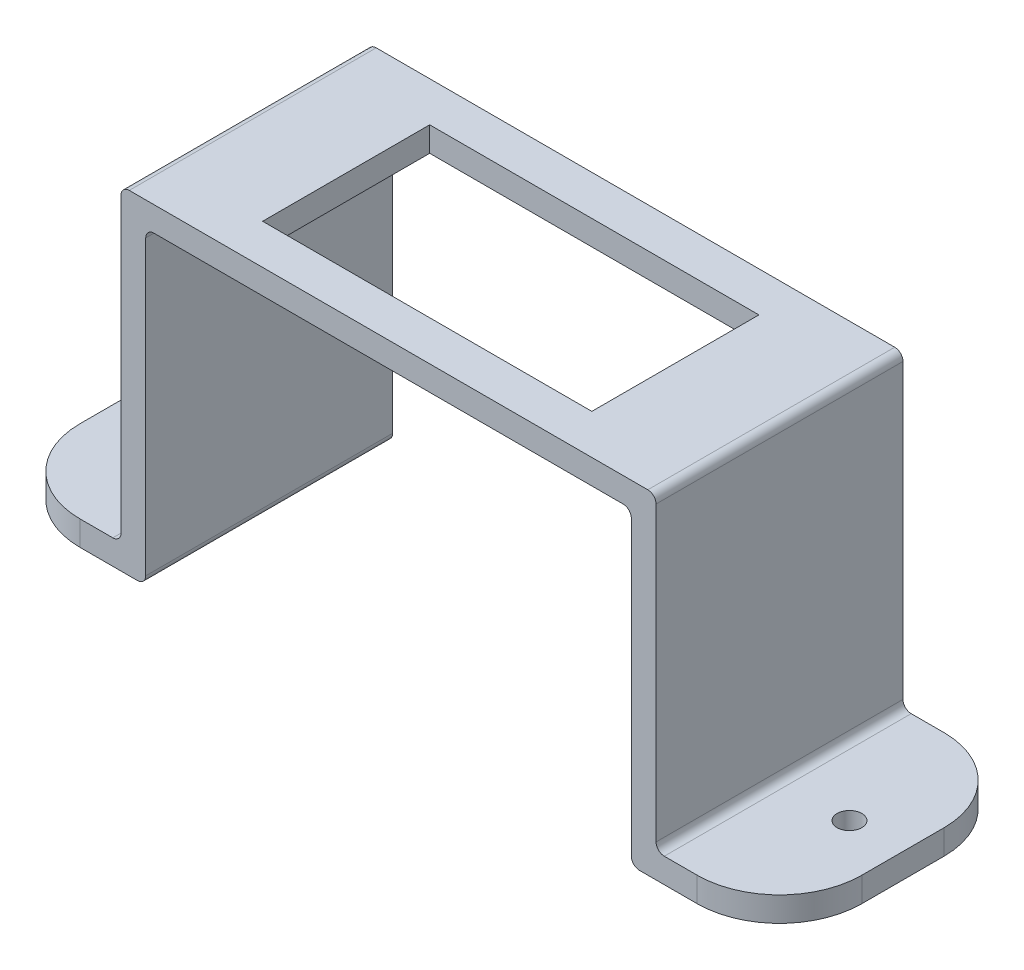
ISO-10303-21;
HEADER;
FILE_DESCRIPTION(('STEP AP214'),'2;1');
FILE_NAME('part.step','',(''),(''),'','','');
FILE_SCHEMA(('AUTOMOTIVE_DESIGN { 1 0 10303 214 1 1 1 1 }'));
ENDSEC;
DATA;
#1=APPLICATION_CONTEXT('core data for automotive mechanical design processes');
#2=APPLICATION_PROTOCOL_DEFINITION('international standard','automotive_design',2000,#1);
#3=PRODUCT_CONTEXT('',#1,'mechanical');
#4=PRODUCT('Part','Part','',(#3));
#5=PRODUCT_RELATED_PRODUCT_CATEGORY('part','',(#4));
#6=PRODUCT_DEFINITION_FORMATION('','',#4);
#7=PRODUCT_DEFINITION_CONTEXT('part definition',#1,'design');
#8=PRODUCT_DEFINITION('design','',#6,#7);
#9=PRODUCT_DEFINITION_SHAPE('','',#8);
#10=(LENGTH_UNIT() NAMED_UNIT(*) SI_UNIT(.MILLI.,.METRE.));
#11=(NAMED_UNIT(*) PLANE_ANGLE_UNIT() SI_UNIT($,.RADIAN.));
#12=(NAMED_UNIT(*) SI_UNIT($,.STERADIAN.) SOLID_ANGLE_UNIT());
#13=UNCERTAINTY_MEASURE_WITH_UNIT(LENGTH_MEASURE(1.E-05),#10,'distance_accuracy_value','');
#14=(GEOMETRIC_REPRESENTATION_CONTEXT(3) GLOBAL_UNCERTAINTY_ASSIGNED_CONTEXT((#13)) GLOBAL_UNIT_ASSIGNED_CONTEXT((#10,
#11,#12)) REPRESENTATION_CONTEXT('',''));
#15=CARTESIAN_POINT('',(0.,0.,0.));
#16=DIRECTION('',(0.,0.,1.));
#17=DIRECTION('',(1.,0.,0.));
#18=AXIS2_PLACEMENT_3D('',#15,#16,#17);
#19=CARTESIAN_POINT('',(80.,-3.,30.));
#20=DIRECTION('',(0.,1.,0.));
#21=DIRECTION('',(0.,0.,1.));
#22=AXIS2_PLACEMENT_3D('',#19,#20,#21);
#23=PLANE('',#22);
#24=CARTESIAN_POINT('',(88.5,-3.,15.));
#25=DIRECTION('',(0.,1.,0.));
#26=DIRECTION('',(0.,0.,1.));
#27=AXIS2_PLACEMENT_3D('',#24,#25,#26);
#28=CIRCLE('',#27,1.5);
#29=CARTESIAN_POINT('',(88.5,-3.,16.5));
#30=VERTEX_POINT('',#29);
#31=EDGE_CURVE('E260',#30,#30,#28,.T.);
#32=ORIENTED_EDGE('',*,*,#31,.T.);
#33=EDGE_LOOP('',(#32));
#34=FACE_BOUND('',#33,.T.);
#35=DIRECTION('',(1.,0.,0.));
#36=VECTOR('',#35,1.);
#37=CARTESIAN_POINT('',(80.,-3.,0.));
#38=LINE('',#37,#36);
#39=CARTESIAN_POINT('',(78.,-3.,0.));
#40=VERTEX_POINT('',#39);
#41=CARTESIAN_POINT('',(85.,-3.,0.));
#42=VERTEX_POINT('',#41);
#43=EDGE_CURVE('E263',#40,#42,#38,.T.);
#44=ORIENTED_EDGE('',*,*,#43,.T.);
#45=CARTESIAN_POINT('',(85.,-3.,10.));
#46=DIRECTION('',(0.,1.,0.));
#47=DIRECTION('',(0.,0.,1.));
#48=AXIS2_PLACEMENT_3D('',#45,#46,#47);
#49=CIRCLE('',#48,10.);
#50=CARTESIAN_POINT('',(95.,-3.,10.));
#51=VERTEX_POINT('',#50);
#52=EDGE_CURVE('E55',#42,#51,#49,.F.);
#53=ORIENTED_EDGE('',*,*,#52,.T.);
#54=DIRECTION('',(0.,0.,-1.));
#55=VECTOR('',#54,1.);
#56=CARTESIAN_POINT('',(95.,-3.,30.));
#57=LINE('',#56,#55);
#58=CARTESIAN_POINT('',(95.,-3.,20.));
#59=VERTEX_POINT('',#58);
#60=EDGE_CURVE('E324',#59,#51,#57,.T.);
#61=ORIENTED_EDGE('',*,*,#60,.F.);
#62=CARTESIAN_POINT('',(85.,-3.,20.));
#63=DIRECTION('',(0.,1.,0.));
#64=DIRECTION('',(0.,0.,1.));
#65=AXIS2_PLACEMENT_3D('',#62,#63,#64);
#66=CIRCLE('',#65,10.);
#67=CARTESIAN_POINT('',(85.,-3.,30.));
#68=VERTEX_POINT('',#67);
#69=EDGE_CURVE('E427',#59,#68,#66,.F.);
#70=ORIENTED_EDGE('',*,*,#69,.T.);
#71=DIRECTION('',(1.,0.,0.));
#72=VECTOR('',#71,1.);
#73=CARTESIAN_POINT('',(80.,-3.,30.));
#74=LINE('',#73,#72);
#75=CARTESIAN_POINT('',(78.,-3.,30.));
#76=VERTEX_POINT('',#75);
#77=EDGE_CURVE('E266',#76,#68,#74,.T.);
#78=ORIENTED_EDGE('',*,*,#77,.F.);
#79=DIRECTION('',(0.,0.,-1.));
#80=VECTOR('',#79,1.);
#81=CARTESIAN_POINT('',(78.,-3.,30.));
#82=LINE('',#81,#80);
#83=EDGE_CURVE('E354',#76,#40,#82,.T.);
#84=ORIENTED_EDGE('',*,*,#83,.T.);
#85=EDGE_LOOP('',(#44,#53,#61,#70,#78,#84));
#86=FACE_BOUND('',#85,.T.);
#87=ADVANCED_FACE('F33',(#34,#86),#23,.F.);
#88=CARTESIAN_POINT('',(95.,0.,30.));
#89=DIRECTION('',(1.,0.,0.));
#90=DIRECTION('',(0.,0.,-1.));
#91=AXIS2_PLACEMENT_3D('',#88,#89,#90);
#92=PLANE('',#91);
#93=ORIENTED_EDGE('',*,*,#60,.T.);
#94=DIRECTION('',(0.,-1.,0.));
#95=VECTOR('',#94,1.);
#96=CARTESIAN_POINT('',(95.,0.,10.));
#97=LINE('',#96,#95);
#98=CARTESIAN_POINT('',(95.,0.,10.));
#99=VERTEX_POINT('',#98);
#100=EDGE_CURVE('E41',#51,#99,#97,.F.);
#101=ORIENTED_EDGE('',*,*,#100,.T.);
#102=DIRECTION('',(0.,0.,-1.));
#103=VECTOR('',#102,1.);
#104=CARTESIAN_POINT('',(95.,0.,30.));
#105=LINE('',#104,#103);
#106=CARTESIAN_POINT('',(95.,0.,20.));
#107=VERTEX_POINT('',#106);
#108=EDGE_CURVE('E322',#107,#99,#105,.T.);
#109=ORIENTED_EDGE('',*,*,#108,.F.);
#110=DIRECTION('',(0.,-1.,0.));
#111=VECTOR('',#110,1.);
#112=CARTESIAN_POINT('',(95.,-3.,20.));
#113=LINE('',#112,#111);
#114=EDGE_CURVE('E424',#107,#59,#113,.T.);
#115=ORIENTED_EDGE('',*,*,#114,.T.);
#116=EDGE_LOOP('',(#93,#101,#109,#115));
#117=FACE_BOUND('',#116,.T.);
#118=ADVANCED_FACE('F551',(#117),#92,.T.);
#119=CARTESIAN_POINT('',(80.,0.,30.));
#120=DIRECTION('',(0.,1.,0.));
#121=DIRECTION('',(0.,0.,1.));
#122=AXIS2_PLACEMENT_3D('',#119,#120,#121);
#123=PLANE('',#122);
#124=CARTESIAN_POINT('',(88.5,0.,15.));
#125=DIRECTION('',(0.,1.,0.));
#126=DIRECTION('',(0.,0.,1.));
#127=AXIS2_PLACEMENT_3D('',#124,#125,#126);
#128=CIRCLE('',#127,1.5);
#129=CARTESIAN_POINT('',(88.5,0.,16.5));
#130=VERTEX_POINT('',#129);
#131=EDGE_CURVE('E257',#130,#130,#128,.T.);
#132=ORIENTED_EDGE('',*,*,#131,.F.);
#133=EDGE_LOOP('',(#132));
#134=FACE_BOUND('',#133,.T.);
#135=ORIENTED_EDGE('',*,*,#108,.T.);
#136=CARTESIAN_POINT('',(85.,0.,10.));
#137=DIRECTION('',(0.,1.,0.));
#138=DIRECTION('',(0.,0.,1.));
#139=AXIS2_PLACEMENT_3D('',#136,#137,#138);
#140=CIRCLE('',#139,10.);
#141=CARTESIAN_POINT('',(85.,0.,0.));
#142=VERTEX_POINT('',#141);
#143=EDGE_CURVE('E11',#99,#142,#140,.T.);
#144=ORIENTED_EDGE('',*,*,#143,.T.);
#145=DIRECTION('',(1.,0.,0.));
#146=VECTOR('',#145,1.);
#147=CARTESIAN_POINT('',(80.,0.,0.));
#148=LINE('',#147,#146);
#149=CARTESIAN_POINT('',(81.,0.,0.));
#150=VERTEX_POINT('',#149);
#151=EDGE_CURVE('E295',#150,#142,#148,.T.);
#152=ORIENTED_EDGE('',*,*,#151,.F.);
#153=DIRECTION('',(0.,0.,-1.));
#154=VECTOR('',#153,1.);
#155=CARTESIAN_POINT('',(81.,0.,30.));
#156=LINE('',#155,#154);
#157=CARTESIAN_POINT('',(81.,0.,30.));
#158=VERTEX_POINT('',#157);
#159=EDGE_CURVE('E397',#150,#158,#156,.F.);
#160=ORIENTED_EDGE('',*,*,#159,.T.);
#161=DIRECTION('',(1.,0.,0.));
#162=VECTOR('',#161,1.);
#163=CARTESIAN_POINT('',(80.,0.,30.));
#164=LINE('',#163,#162);
#165=CARTESIAN_POINT('',(85.,0.,30.));
#166=VERTEX_POINT('',#165);
#167=EDGE_CURVE('E269',#158,#166,#164,.T.);
#168=ORIENTED_EDGE('',*,*,#167,.T.);
#169=CARTESIAN_POINT('',(85.,0.,20.));
#170=DIRECTION('',(0.,1.,0.));
#171=DIRECTION('',(0.,0.,1.));
#172=AXIS2_PLACEMENT_3D('',#169,#170,#171);
#173=CIRCLE('',#172,10.);
#174=EDGE_CURVE('E429',#166,#107,#173,.T.);
#175=ORIENTED_EDGE('',*,*,#174,.T.);
#176=EDGE_LOOP('',(#135,#144,#152,#160,#168,#175));
#177=FACE_BOUND('',#176,.T.);
#178=ADVANCED_FACE('F506',(#134,#177),#123,.T.);
#179=CARTESIAN_POINT('',(80.,37.5557142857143,30.));
#180=DIRECTION('',(1.,0.,0.));
#181=DIRECTION('',(0.,0.,-1.));
#182=AXIS2_PLACEMENT_3D('',#179,#180,#181);
#183=PLANE('',#182);
#184=DIRECTION('',(0.,-1.,0.));
#185=VECTOR('',#184,1.);
#186=CARTESIAN_POINT('',(80.,37.5557142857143,30.));
#187=LINE('',#186,#185);
#188=CARTESIAN_POINT('',(80.,36.5557142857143,30.));
#189=VERTEX_POINT('',#188);
#190=CARTESIAN_POINT('',(80.,1.,30.));
#191=VERTEX_POINT('',#190);
#192=EDGE_CURVE('E273',#189,#191,#187,.T.);
#193=ORIENTED_EDGE('',*,*,#192,.T.);
#194=DIRECTION('',(0.,0.,-1.));
#195=VECTOR('',#194,1.);
#196=CARTESIAN_POINT('',(80.,1.,0.));
#197=LINE('',#196,#195);
#198=CARTESIAN_POINT('',(80.,1.,0.));
#199=VERTEX_POINT('',#198);
#200=EDGE_CURVE('E394',#191,#199,#197,.T.);
#201=ORIENTED_EDGE('',*,*,#200,.T.);
#202=DIRECTION('',(0.,-1.,0.));
#203=VECTOR('',#202,1.);
#204=CARTESIAN_POINT('',(80.,37.5557142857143,0.));
#205=LINE('',#204,#203);
#206=CARTESIAN_POINT('',(80.,36.5557142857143,0.));
#207=VERTEX_POINT('',#206);
#208=EDGE_CURVE('E298',#207,#199,#205,.T.);
#209=ORIENTED_EDGE('',*,*,#208,.F.);
#210=DIRECTION('',(0.,0.,-1.));
#211=VECTOR('',#210,1.);
#212=CARTESIAN_POINT('',(80.,36.5557142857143,30.));
#213=LINE('',#212,#211);
#214=EDGE_CURVE('E352',#207,#189,#213,.F.);
#215=ORIENTED_EDGE('',*,*,#214,.T.);
#216=EDGE_LOOP('',(#193,#201,#209,#215));
#217=FACE_BOUND('',#216,.T.);
#218=ADVANCED_FACE('F496',(#217),#183,.T.);
#219=CARTESIAN_POINT('',(15.,37.5557142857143,30.));
#220=DIRECTION('',(0.,1.,0.));
#221=DIRECTION('',(0.,0.,1.));
#222=AXIS2_PLACEMENT_3D('',#219,#220,#221);
#223=PLANE('',#222);
#224=DIRECTION('',(0.,0.,1.));
#225=VECTOR('',#224,1.);
#226=CARTESIAN_POINT('',(27.35,37.5557142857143,25.15));
#227=LINE('',#226,#225);
#228=CARTESIAN_POINT('',(27.35,37.5557142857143,4.85));
#229=VERTEX_POINT('',#228);
#230=CARTESIAN_POINT('',(27.35,37.5557142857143,25.15));
#231=VERTEX_POINT('',#230);
#232=EDGE_CURVE('E239',#229,#231,#227,.T.);
#233=ORIENTED_EDGE('',*,*,#232,.F.);
#234=DIRECTION('',(-1.,0.,0.));
#235=VECTOR('',#234,1.);
#236=CARTESIAN_POINT('',(27.35,37.5557142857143,4.85));
#237=LINE('',#236,#235);
#238=CARTESIAN_POINT('',(67.35,37.5557142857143,4.85));
#239=VERTEX_POINT('',#238);
#240=EDGE_CURVE('E244',#239,#229,#237,.T.);
#241=ORIENTED_EDGE('',*,*,#240,.F.);
#242=DIRECTION('',(0.,0.,-1.));
#243=VECTOR('',#242,1.);
#244=CARTESIAN_POINT('',(67.35,37.5557142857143,25.15));
#245=LINE('',#244,#243);
#246=CARTESIAN_POINT('',(67.35,37.5557142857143,25.15));
#247=VERTEX_POINT('',#246);
#248=EDGE_CURVE('E223',#247,#239,#245,.T.);
#249=ORIENTED_EDGE('',*,*,#248,.F.);
#250=DIRECTION('',(1.,0.,0.));
#251=VECTOR('',#250,1.);
#252=CARTESIAN_POINT('',(27.35,37.5557142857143,25.15));
#253=LINE('',#252,#251);
#254=EDGE_CURVE('E234',#231,#247,#253,.T.);
#255=ORIENTED_EDGE('',*,*,#254,.F.);
#256=EDGE_LOOP('',(#233,#241,#249,#255));
#257=FACE_BOUND('',#256,.T.);
#258=DIRECTION('',(1.,0.,0.));
#259=VECTOR('',#258,1.);
#260=CARTESIAN_POINT('',(15.,37.5557142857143,0.));
#261=LINE('',#260,#259);
#262=CARTESIAN_POINT('',(16.,37.5557142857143,0.));
#263=VERTEX_POINT('',#262);
#264=CARTESIAN_POINT('',(79.,37.5557142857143,0.));
#265=VERTEX_POINT('',#264);
#266=EDGE_CURVE('E301',#263,#265,#261,.T.);
#267=ORIENTED_EDGE('',*,*,#266,.F.);
#268=DIRECTION('',(0.,0.,-1.));
#269=VECTOR('',#268,1.);
#270=CARTESIAN_POINT('',(16.,37.5557142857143,30.));
#271=LINE('',#270,#269);
#272=CARTESIAN_POINT('',(16.,37.5557142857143,30.));
#273=VERTEX_POINT('',#272);
#274=EDGE_CURVE('E345',#263,#273,#271,.F.);
#275=ORIENTED_EDGE('',*,*,#274,.T.);
#276=DIRECTION('',(1.,0.,0.));
#277=VECTOR('',#276,1.);
#278=CARTESIAN_POINT('',(15.,37.5557142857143,30.));
#279=LINE('',#278,#277);
#280=CARTESIAN_POINT('',(79.,37.5557142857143,30.));
#281=VERTEX_POINT('',#280);
#282=EDGE_CURVE('E276',#273,#281,#279,.T.);
#283=ORIENTED_EDGE('',*,*,#282,.T.);
#284=DIRECTION('',(0.,0.,-1.));
#285=VECTOR('',#284,1.);
#286=CARTESIAN_POINT('',(79.,37.5557142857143,30.));
#287=LINE('',#286,#285);
#288=EDGE_CURVE('E342',#281,#265,#287,.T.);
#289=ORIENTED_EDGE('',*,*,#288,.T.);
#290=EDGE_LOOP('',(#267,#275,#283,#289));
#291=FACE_BOUND('',#290,.T.);
#292=ADVANCED_FACE('F241',(#257,#291),#223,.T.);
#293=CARTESIAN_POINT('',(15.,0.,30.));
#294=DIRECTION('',(-1.,0.,0.));
#295=DIRECTION('',(0.,0.,1.));
#296=AXIS2_PLACEMENT_3D('',#293,#294,#295);
#297=PLANE('',#296);
#298=DIRECTION('',(0.,1.,0.));
#299=VECTOR('',#298,1.);
#300=CARTESIAN_POINT('',(15.,0.,0.));
#301=LINE('',#300,#299);
#302=CARTESIAN_POINT('',(15.,1.,0.));
#303=VERTEX_POINT('',#302);
#304=CARTESIAN_POINT('',(15.,36.5557142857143,0.));
#305=VERTEX_POINT('',#304);
#306=EDGE_CURVE('E304',#303,#305,#301,.T.);
#307=ORIENTED_EDGE('',*,*,#306,.F.);
#308=DIRECTION('',(0.,0.,-1.));
#309=VECTOR('',#308,1.);
#310=CARTESIAN_POINT('',(15.,1.,30.));
#311=LINE('',#310,#309);
#312=CARTESIAN_POINT('',(15.,1.,30.));
#313=VERTEX_POINT('',#312);
#314=EDGE_CURVE('E406',#303,#313,#311,.F.);
#315=ORIENTED_EDGE('',*,*,#314,.T.);
#316=DIRECTION('',(0.,1.,0.));
#317=VECTOR('',#316,1.);
#318=CARTESIAN_POINT('',(15.,0.,30.));
#319=LINE('',#318,#317);
#320=CARTESIAN_POINT('',(15.,36.5557142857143,30.));
#321=VERTEX_POINT('',#320);
#322=EDGE_CURVE('E279',#313,#321,#319,.T.);
#323=ORIENTED_EDGE('',*,*,#322,.T.);
#324=DIRECTION('',(0.,0.,-1.));
#325=VECTOR('',#324,1.);
#326=CARTESIAN_POINT('',(15.,36.5557142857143,30.));
#327=LINE('',#326,#325);
#328=EDGE_CURVE('E335',#321,#305,#327,.T.);
#329=ORIENTED_EDGE('',*,*,#328,.T.);
#330=EDGE_LOOP('',(#307,#315,#323,#329));
#331=FACE_BOUND('',#330,.T.);
#332=ADVANCED_FACE('F481',(#331),#297,.T.);
#333=CARTESIAN_POINT('',(0.,0.,30.));
#334=DIRECTION('',(0.,1.,0.));
#335=DIRECTION('',(0.,0.,1.));
#336=AXIS2_PLACEMENT_3D('',#333,#334,#335);
#337=PLANE('',#336);
#338=CARTESIAN_POINT('',(7.5,0.,15.));
#339=DIRECTION('',(0.,1.,0.));
#340=DIRECTION('',(0.,0.,1.));
#341=AXIS2_PLACEMENT_3D('',#338,#339,#340);
#342=CIRCLE('',#341,1.5);
#343=CARTESIAN_POINT('',(7.5,0.,16.5));
#344=VERTEX_POINT('',#343);
#345=EDGE_CURVE('E251',#344,#344,#342,.T.);
#346=ORIENTED_EDGE('',*,*,#345,.F.);
#347=EDGE_LOOP('',(#346));
#348=FACE_BOUND('',#347,.T.);
#349=DIRECTION('',(1.,0.,0.));
#350=VECTOR('',#349,1.);
#351=CARTESIAN_POINT('',(0.,0.,0.));
#352=LINE('',#351,#350);
#353=CARTESIAN_POINT('',(9.99999999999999,0.,0.));
#354=VERTEX_POINT('',#353);
#355=CARTESIAN_POINT('',(14.,0.,0.));
#356=VERTEX_POINT('',#355);
#357=EDGE_CURVE('E306',#354,#356,#352,.T.);
#358=ORIENTED_EDGE('',*,*,#357,.F.);
#359=CARTESIAN_POINT('',(9.99999999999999,0.,10.));
#360=DIRECTION('',(0.,1.,0.));
#361=DIRECTION('',(0.,0.,1.));
#362=AXIS2_PLACEMENT_3D('',#359,#360,#361);
#363=CIRCLE('',#362,10.);
#364=CARTESIAN_POINT('',(0.,0.,10.));
#365=VERTEX_POINT('',#364);
#366=EDGE_CURVE('E437',#354,#365,#363,.T.);
#367=ORIENTED_EDGE('',*,*,#366,.T.);
#368=DIRECTION('',(0.,0.,-1.));
#369=VECTOR('',#368,1.);
#370=CARTESIAN_POINT('',(0.,0.,30.));
#371=LINE('',#370,#369);
#372=CARTESIAN_POINT('',(0.,0.,20.));
#373=VERTEX_POINT('',#372);
#374=EDGE_CURVE('E319',#373,#365,#371,.T.);
#375=ORIENTED_EDGE('',*,*,#374,.F.);
#376=CARTESIAN_POINT('',(10.,0.,20.));
#377=DIRECTION('',(0.,1.,0.));
#378=DIRECTION('',(0.,0.,1.));
#379=AXIS2_PLACEMENT_3D('',#376,#377,#378);
#380=CIRCLE('',#379,10.);
#381=CARTESIAN_POINT('',(10.,0.,30.));
#382=VERTEX_POINT('',#381);
#383=EDGE_CURVE('E416',#373,#382,#380,.T.);
#384=ORIENTED_EDGE('',*,*,#383,.T.);
#385=DIRECTION('',(1.,0.,0.));
#386=VECTOR('',#385,1.);
#387=CARTESIAN_POINT('',(0.,0.,30.));
#388=LINE('',#387,#386);
#389=CARTESIAN_POINT('',(14.,0.,30.));
#390=VERTEX_POINT('',#389);
#391=EDGE_CURVE('E281',#382,#390,#388,.T.);
#392=ORIENTED_EDGE('',*,*,#391,.T.);
#393=DIRECTION('',(0.,0.,-1.));
#394=VECTOR('',#393,1.);
#395=CARTESIAN_POINT('',(14.,0.,0.));
#396=LINE('',#395,#394);
#397=EDGE_CURVE('E403',#390,#356,#396,.T.);
#398=ORIENTED_EDGE('',*,*,#397,.T.);
#399=EDGE_LOOP('',(#358,#367,#375,#384,#392,#398));
#400=FACE_BOUND('',#399,.T.);
#401=ADVANCED_FACE('F459',(#348,#400),#337,.T.);
#402=CARTESIAN_POINT('',(0.,-3.,30.));
#403=DIRECTION('',(-1.,0.,0.));
#404=DIRECTION('',(0.,0.,1.));
#405=AXIS2_PLACEMENT_3D('',#402,#403,#404);
#406=PLANE('',#405);
#407=ORIENTED_EDGE('',*,*,#374,.T.);
#408=DIRECTION('',(0.,1.,0.));
#409=VECTOR('',#408,1.);
#410=CARTESIAN_POINT('',(0.,-3.,10.));
#411=LINE('',#410,#409);
#412=CARTESIAN_POINT('',(0.,-3.,10.));
#413=VERTEX_POINT('',#412);
#414=EDGE_CURVE('E439',#365,#413,#411,.F.);
#415=ORIENTED_EDGE('',*,*,#414,.T.);
#416=DIRECTION('',(0.,0.,-1.));
#417=VECTOR('',#416,1.);
#418=CARTESIAN_POINT('',(0.,-3.,30.));
#419=LINE('',#418,#417);
#420=CARTESIAN_POINT('',(0.,-3.,20.));
#421=VERTEX_POINT('',#420);
#422=EDGE_CURVE('E293',#421,#413,#419,.T.);
#423=ORIENTED_EDGE('',*,*,#422,.F.);
#424=DIRECTION('',(0.,1.,0.));
#425=VECTOR('',#424,1.);
#426=CARTESIAN_POINT('',(0.,0.,20.));
#427=LINE('',#426,#425);
#428=EDGE_CURVE('E413',#421,#373,#427,.T.);
#429=ORIENTED_EDGE('',*,*,#428,.T.);
#430=EDGE_LOOP('',(#407,#415,#423,#429));
#431=FACE_BOUND('',#430,.T.);
#432=ADVANCED_FACE('F461',(#431),#406,.T.);
#433=CARTESIAN_POINT('',(0.,-3.,30.));
#434=DIRECTION('',(0.,1.,0.));
#435=DIRECTION('',(0.,0.,1.));
#436=AXIS2_PLACEMENT_3D('',#433,#434,#435);
#437=PLANE('',#436);
#438=CARTESIAN_POINT('',(7.5,-3.,15.));
#439=DIRECTION('',(0.,1.,0.));
#440=DIRECTION('',(0.,0.,1.));
#441=AXIS2_PLACEMENT_3D('',#438,#439,#440);
#442=CIRCLE('',#441,1.5);
#443=CARTESIAN_POINT('',(7.5,-3.,16.5));
#444=VERTEX_POINT('',#443);
#445=EDGE_CURVE('E254',#444,#444,#442,.T.);
#446=ORIENTED_EDGE('',*,*,#445,.T.);
#447=EDGE_LOOP('',(#446));
#448=FACE_BOUND('',#447,.T.);
#449=ORIENTED_EDGE('',*,*,#422,.T.);
#450=CARTESIAN_POINT('',(9.99999999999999,-3.,10.));
#451=DIRECTION('',(0.,1.,0.));
#452=DIRECTION('',(0.,0.,1.));
#453=AXIS2_PLACEMENT_3D('',#450,#451,#452);
#454=CIRCLE('',#453,10.);
#455=CARTESIAN_POINT('',(9.99999999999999,-3.,0.));
#456=VERTEX_POINT('',#455);
#457=EDGE_CURVE('E441',#413,#456,#454,.F.);
#458=ORIENTED_EDGE('',*,*,#457,.T.);
#459=DIRECTION('',(1.,0.,0.));
#460=VECTOR('',#459,1.);
#461=CARTESIAN_POINT('',(0.,-3.,0.));
#462=LINE('',#461,#460);
#463=CARTESIAN_POINT('',(17.,-3.,0.));
#464=VERTEX_POINT('',#463);
#465=EDGE_CURVE('E308',#456,#464,#462,.T.);
#466=ORIENTED_EDGE('',*,*,#465,.T.);
#467=DIRECTION('',(0.,0.,-1.));
#468=VECTOR('',#467,1.);
#469=CARTESIAN_POINT('',(17.,-3.,30.));
#470=LINE('',#469,#468);
#471=CARTESIAN_POINT('',(17.,-3.,30.));
#472=VERTEX_POINT('',#471);
#473=EDGE_CURVE('E382',#464,#472,#470,.F.);
#474=ORIENTED_EDGE('',*,*,#473,.T.);
#475=DIRECTION('',(1.,0.,0.));
#476=VECTOR('',#475,1.);
#477=CARTESIAN_POINT('',(0.,-3.,30.));
#478=LINE('',#477,#476);
#479=CARTESIAN_POINT('',(10.,-3.,30.));
#480=VERTEX_POINT('',#479);
#481=EDGE_CURVE('E283',#480,#472,#478,.T.);
#482=ORIENTED_EDGE('',*,*,#481,.F.);
#483=CARTESIAN_POINT('',(10.,-3.,20.));
#484=DIRECTION('',(0.,1.,0.));
#485=DIRECTION('',(0.,0.,1.));
#486=AXIS2_PLACEMENT_3D('',#483,#484,#485);
#487=CIRCLE('',#486,10.);
#488=EDGE_CURVE('E422',#480,#421,#487,.F.);
#489=ORIENTED_EDGE('',*,*,#488,.T.);
#490=EDGE_LOOP('',(#449,#458,#466,#474,#482,#489));
#491=FACE_BOUND('',#490,.T.);
#492=ADVANCED_FACE('F446',(#448,#491),#437,.F.);
#493=CARTESIAN_POINT('',(18.,0.,30.));
#494=DIRECTION('',(-1.,0.,0.));
#495=DIRECTION('',(0.,0.,1.));
#496=AXIS2_PLACEMENT_3D('',#493,#494,#495);
#497=PLANE('',#496);
#498=DIRECTION('',(0.,1.,0.));
#499=VECTOR('',#498,1.);
#500=CARTESIAN_POINT('',(18.,0.,30.));
#501=LINE('',#500,#499);
#502=CARTESIAN_POINT('',(18.,-2.,30.));
#503=VERTEX_POINT('',#502);
#504=CARTESIAN_POINT('',(18.,33.5557142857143,30.));
#505=VERTEX_POINT('',#504);
#506=EDGE_CURVE('E285',#503,#505,#501,.T.);
#507=ORIENTED_EDGE('',*,*,#506,.F.);
#508=DIRECTION('',(0.,0.,-1.));
#509=VECTOR('',#508,1.);
#510=CARTESIAN_POINT('',(18.,-2.,30.));
#511=LINE('',#510,#509);
#512=CARTESIAN_POINT('',(18.,-2.,0.));
#513=VERTEX_POINT('',#512);
#514=EDGE_CURVE('E376',#503,#513,#511,.T.);
#515=ORIENTED_EDGE('',*,*,#514,.T.);
#516=DIRECTION('',(0.,1.,0.));
#517=VECTOR('',#516,1.);
#518=CARTESIAN_POINT('',(18.,0.,0.));
#519=LINE('',#518,#517);
#520=CARTESIAN_POINT('',(18.,33.5557142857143,0.));
#521=VERTEX_POINT('',#520);
#522=EDGE_CURVE('E310',#513,#521,#519,.T.);
#523=ORIENTED_EDGE('',*,*,#522,.T.);
#524=DIRECTION('',(0.,0.,-1.));
#525=VECTOR('',#524,1.);
#526=CARTESIAN_POINT('',(18.,33.5557142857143,30.));
#527=LINE('',#526,#525);
#528=EDGE_CURVE('E374',#521,#505,#527,.F.);
#529=ORIENTED_EDGE('',*,*,#528,.T.);
#530=EDGE_LOOP('',(#507,#515,#523,#529));
#531=FACE_BOUND('',#530,.T.);
#532=ADVANCED_FACE('F537',(#531),#497,.F.);
#533=CARTESIAN_POINT('',(15.,34.5557142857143,30.));
#534=DIRECTION('',(0.,1.,0.));
#535=DIRECTION('',(0.,0.,1.));
#536=AXIS2_PLACEMENT_3D('',#533,#534,#535);
#537=PLANE('',#536);
#538=DIRECTION('',(-1.,0.,0.));
#539=VECTOR('',#538,1.);
#540=CARTESIAN_POINT('',(15.,34.5557142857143,4.85));
#541=LINE('',#540,#539);
#542=CARTESIAN_POINT('',(67.35,34.5557142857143,4.85));
#543=VERTEX_POINT('',#542);
#544=CARTESIAN_POINT('',(27.35,34.5557142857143,4.85));
#545=VERTEX_POINT('',#544);
#546=EDGE_CURVE('E329',#543,#545,#541,.T.);
#547=ORIENTED_EDGE('',*,*,#546,.T.);
#548=DIRECTION('',(0.,0.,1.));
#549=VECTOR('',#548,1.);
#550=CARTESIAN_POINT('',(27.35,34.5557142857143,30.));
#551=LINE('',#550,#549);
#552=CARTESIAN_POINT('',(27.35,34.5557142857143,25.15));
#553=VERTEX_POINT('',#552);
#554=EDGE_CURVE('E332',#545,#553,#551,.T.);
#555=ORIENTED_EDGE('',*,*,#554,.T.);
#556=DIRECTION('',(1.,0.,0.));
#557=VECTOR('',#556,1.);
#558=CARTESIAN_POINT('',(15.,34.5557142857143,25.15));
#559=LINE('',#558,#557);
#560=CARTESIAN_POINT('',(67.35,34.5557142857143,25.15));
#561=VERTEX_POINT('',#560);
#562=EDGE_CURVE('E326',#553,#561,#559,.T.);
#563=ORIENTED_EDGE('',*,*,#562,.T.);
#564=DIRECTION('',(0.,0.,-1.));
#565=VECTOR('',#564,1.);
#566=CARTESIAN_POINT('',(67.35,34.5557142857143,30.));
#567=LINE('',#566,#565);
#568=EDGE_CURVE('E226',#561,#543,#567,.T.);
#569=ORIENTED_EDGE('',*,*,#568,.T.);
#570=EDGE_LOOP('',(#547,#555,#563,#569));
#571=FACE_BOUND('',#570,.T.);
#572=DIRECTION('',(1.,0.,0.));
#573=VECTOR('',#572,1.);
#574=CARTESIAN_POINT('',(15.,34.5557142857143,30.));
#575=LINE('',#574,#573);
#576=CARTESIAN_POINT('',(19.,34.5557142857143,30.));
#577=VERTEX_POINT('',#576);
#578=CARTESIAN_POINT('',(76.,34.5557142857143,30.));
#579=VERTEX_POINT('',#578);
#580=EDGE_CURVE('E288',#577,#579,#575,.T.);
#581=ORIENTED_EDGE('',*,*,#580,.F.);
#582=DIRECTION('',(0.,0.,-1.));
#583=VECTOR('',#582,1.);
#584=CARTESIAN_POINT('',(19.,34.5557142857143,0.));
#585=LINE('',#584,#583);
#586=CARTESIAN_POINT('',(19.,34.5557142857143,0.));
#587=VERTEX_POINT('',#586);
#588=EDGE_CURVE('E387',#577,#587,#585,.T.);
#589=ORIENTED_EDGE('',*,*,#588,.T.);
#590=DIRECTION('',(1.,0.,0.));
#591=VECTOR('',#590,1.);
#592=CARTESIAN_POINT('',(15.,34.5557142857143,0.));
#593=LINE('',#592,#591);
#594=CARTESIAN_POINT('',(76.,34.5557142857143,0.));
#595=VERTEX_POINT('',#594);
#596=EDGE_CURVE('E313',#587,#595,#593,.T.);
#597=ORIENTED_EDGE('',*,*,#596,.T.);
#598=DIRECTION('',(0.,0.,-1.));
#599=VECTOR('',#598,1.);
#600=CARTESIAN_POINT('',(76.,34.5557142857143,30.));
#601=LINE('',#600,#599);
#602=EDGE_CURVE('E366',#595,#579,#601,.F.);
#603=ORIENTED_EDGE('',*,*,#602,.T.);
#604=EDGE_LOOP('',(#581,#589,#597,#603));
#605=FACE_BOUND('',#604,.T.);
#606=ADVANCED_FACE('F529',(#571,#605),#537,.F.);
#607=CARTESIAN_POINT('',(77.,37.5557142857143,30.));
#608=DIRECTION('',(1.,0.,0.));
#609=DIRECTION('',(0.,0.,-1.));
#610=AXIS2_PLACEMENT_3D('',#607,#608,#609);
#611=PLANE('',#610);
#612=DIRECTION('',(0.,1.,0.));
#613=VECTOR('',#612,1.);
#614=CARTESIAN_POINT('',(77.,37.5557142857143,0.));
#615=LINE('',#614,#613);
#616=CARTESIAN_POINT('',(77.,33.5557142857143,0.));
#617=VERTEX_POINT('',#616);
#618=CARTESIAN_POINT('',(77.,-2.,0.));
#619=VERTEX_POINT('',#618);
#620=EDGE_CURVE('E270',#617,#619,#615,.F.);
#621=ORIENTED_EDGE('',*,*,#620,.T.);
#622=DIRECTION('',(0.,0.,-1.));
#623=VECTOR('',#622,1.);
#624=CARTESIAN_POINT('',(77.,-2.,30.));
#625=LINE('',#624,#623);
#626=CARTESIAN_POINT('',(77.,-2.,30.));
#627=VERTEX_POINT('',#626);
#628=EDGE_CURVE('E362',#619,#627,#625,.F.);
#629=ORIENTED_EDGE('',*,*,#628,.T.);
#630=DIRECTION('',(0.,1.,0.));
#631=VECTOR('',#630,1.);
#632=CARTESIAN_POINT('',(77.,37.5557142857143,30.));
#633=LINE('',#632,#631);
#634=CARTESIAN_POINT('',(77.,33.5557142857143,30.));
#635=VERTEX_POINT('',#634);
#636=EDGE_CURVE('E290',#635,#627,#633,.F.);
#637=ORIENTED_EDGE('',*,*,#636,.F.);
#638=DIRECTION('',(0.,0.,-1.));
#639=VECTOR('',#638,1.);
#640=CARTESIAN_POINT('',(77.,33.5557142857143,0.));
#641=LINE('',#640,#639);
#642=EDGE_CURVE('E359',#635,#617,#641,.T.);
#643=ORIENTED_EDGE('',*,*,#642,.T.);
#644=EDGE_LOOP('',(#621,#629,#637,#643));
#645=FACE_BOUND('',#644,.T.);
#646=ADVANCED_FACE('F519',(#645),#611,.F.);
#647=CARTESIAN_POINT('',(95.,-3.,30.));
#648=DIRECTION('',(0.,0.,-1.));
#649=DIRECTION('',(-1.,0.,0.));
#650=AXIS2_PLACEMENT_3D('',#647,#648,#649);
#651=PLANE('',#650);
#652=ORIENTED_EDGE('',*,*,#391,.F.);
#653=DIRECTION('',(0.,1.,0.));
#654=VECTOR('',#653,1.);
#655=CARTESIAN_POINT('',(10.,-3.,30.));
#656=LINE('',#655,#654);
#657=EDGE_CURVE('E420',#382,#480,#656,.F.);
#658=ORIENTED_EDGE('',*,*,#657,.T.);
#659=ORIENTED_EDGE('',*,*,#481,.T.);
#660=CARTESIAN_POINT('',(17.,-2.,30.));
#661=DIRECTION('',(0.,0.,-1.));
#662=DIRECTION('',(-1.,0.,0.));
#663=AXIS2_PLACEMENT_3D('',#660,#661,#662);
#664=CIRCLE('',#663,1.);
#665=EDGE_CURVE('E385',#472,#503,#664,.F.);
#666=ORIENTED_EDGE('',*,*,#665,.T.);
#667=ORIENTED_EDGE('',*,*,#506,.T.);
#668=CARTESIAN_POINT('',(19.,33.5557142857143,30.));
#669=DIRECTION('',(0.,0.,-1.));
#670=DIRECTION('',(-1.,0.,0.));
#671=AXIS2_PLACEMENT_3D('',#668,#669,#670);
#672=CIRCLE('',#671,1.);
#673=EDGE_CURVE('E392',#505,#577,#672,.T.);
#674=ORIENTED_EDGE('',*,*,#673,.T.);
#675=ORIENTED_EDGE('',*,*,#580,.T.);
#676=CARTESIAN_POINT('',(76.,33.5557142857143,30.));
#677=DIRECTION('',(0.,0.,-1.));
#678=DIRECTION('',(-1.,0.,0.));
#679=AXIS2_PLACEMENT_3D('',#676,#677,#678);
#680=CIRCLE('',#679,1.);
#681=EDGE_CURVE('E372',#579,#635,#680,.T.);
#682=ORIENTED_EDGE('',*,*,#681,.T.);
#683=ORIENTED_EDGE('',*,*,#636,.T.);
#684=CARTESIAN_POINT('',(78.,-2.,30.));
#685=DIRECTION('',(0.,0.,-1.));
#686=DIRECTION('',(-1.,0.,0.));
#687=AXIS2_PLACEMENT_3D('',#684,#685,#686);
#688=CIRCLE('',#687,1.);
#689=EDGE_CURVE('E364',#627,#76,#688,.F.);
#690=ORIENTED_EDGE('',*,*,#689,.T.);
#691=ORIENTED_EDGE('',*,*,#77,.T.);
#692=DIRECTION('',(0.,-1.,0.));
#693=VECTOR('',#692,1.);
#694=CARTESIAN_POINT('',(85.,0.,30.));
#695=LINE('',#694,#693);
#696=EDGE_CURVE('E418',#68,#166,#695,.F.);
#697=ORIENTED_EDGE('',*,*,#696,.T.);
#698=ORIENTED_EDGE('',*,*,#167,.F.);
#699=CARTESIAN_POINT('',(81.,1.,30.));
#700=DIRECTION('',(0.,0.,-1.));
#701=DIRECTION('',(-1.,0.,0.));
#702=AXIS2_PLACEMENT_3D('',#699,#700,#701);
#703=CIRCLE('',#702,1.);
#704=EDGE_CURVE('E401',#158,#191,#703,.T.);
#705=ORIENTED_EDGE('',*,*,#704,.T.);
#706=ORIENTED_EDGE('',*,*,#192,.F.);
#707=CARTESIAN_POINT('',(79.,36.5557142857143,30.));
#708=DIRECTION('',(0.,0.,-1.));
#709=DIRECTION('',(-1.,0.,0.));
#710=AXIS2_PLACEMENT_3D('',#707,#708,#709);
#711=CIRCLE('',#710,1.);
#712=EDGE_CURVE('E347',#189,#281,#711,.F.);
#713=ORIENTED_EDGE('',*,*,#712,.T.);
#714=ORIENTED_EDGE('',*,*,#282,.F.);
#715=CARTESIAN_POINT('',(16.,36.5557142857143,30.));
#716=DIRECTION('',(0.,0.,-1.));
#717=DIRECTION('',(-1.,0.,0.));
#718=AXIS2_PLACEMENT_3D('',#715,#716,#717);
#719=CIRCLE('',#718,1.);
#720=EDGE_CURVE('E349',#273,#321,#719,.F.);
#721=ORIENTED_EDGE('',*,*,#720,.T.);
#722=ORIENTED_EDGE('',*,*,#322,.F.);
#723=CARTESIAN_POINT('',(14.,1.,30.));
#724=DIRECTION('',(0.,0.,-1.));
#725=DIRECTION('',(-1.,0.,0.));
#726=AXIS2_PLACEMENT_3D('',#723,#724,#725);
#727=CIRCLE('',#726,1.);
#728=EDGE_CURVE('E410',#313,#390,#727,.T.);
#729=ORIENTED_EDGE('',*,*,#728,.T.);
#730=EDGE_LOOP('',(#652,#658,#659,#666,#667,#674,#675,#682,#683,#690,#691,#697,#698,#705,#706,
#713,#714,#721,#722,#729));
#731=FACE_BOUND('',#730,.T.);
#732=ADVANCED_FACE('F469',(#731),#651,.F.);
#733=CARTESIAN_POINT('',(95.,-3.,0.));
#734=DIRECTION('',(0.,0.,-1.));
#735=DIRECTION('',(-1.,0.,0.));
#736=AXIS2_PLACEMENT_3D('',#733,#734,#735);
#737=PLANE('',#736);
#738=ORIENTED_EDGE('',*,*,#465,.F.);
#739=DIRECTION('',(0.,1.,0.));
#740=VECTOR('',#739,1.);
#741=CARTESIAN_POINT('',(9.99999999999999,-3.,0.));
#742=LINE('',#741,#740);
#743=EDGE_CURVE('E434',#456,#354,#742,.T.);
#744=ORIENTED_EDGE('',*,*,#743,.T.);
#745=ORIENTED_EDGE('',*,*,#357,.T.);
#746=CARTESIAN_POINT('',(14.,1.,0.));
#747=DIRECTION('',(0.,0.,-1.));
#748=DIRECTION('',(-1.,0.,0.));
#749=AXIS2_PLACEMENT_3D('',#746,#747,#748);
#750=CIRCLE('',#749,1.);
#751=EDGE_CURVE('E408',#356,#303,#750,.F.);
#752=ORIENTED_EDGE('',*,*,#751,.T.);
#753=ORIENTED_EDGE('',*,*,#306,.T.);
#754=CARTESIAN_POINT('',(16.,36.5557142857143,0.));
#755=DIRECTION('',(0.,0.,-1.));
#756=DIRECTION('',(-1.,0.,0.));
#757=AXIS2_PLACEMENT_3D('',#754,#755,#756);
#758=CIRCLE('',#757,1.);
#759=EDGE_CURVE('E340',#305,#263,#758,.T.);
#760=ORIENTED_EDGE('',*,*,#759,.T.);
#761=ORIENTED_EDGE('',*,*,#266,.T.);
#762=CARTESIAN_POINT('',(79.,36.5557142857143,0.));
#763=DIRECTION('',(0.,0.,-1.));
#764=DIRECTION('',(-1.,0.,0.));
#765=AXIS2_PLACEMENT_3D('',#762,#763,#764);
#766=CIRCLE('',#765,1.);
#767=EDGE_CURVE('E338',#265,#207,#766,.T.);
#768=ORIENTED_EDGE('',*,*,#767,.T.);
#769=ORIENTED_EDGE('',*,*,#208,.T.);
#770=CARTESIAN_POINT('',(81.,1.,0.));
#771=DIRECTION('',(0.,0.,-1.));
#772=DIRECTION('',(-1.,0.,0.));
#773=AXIS2_PLACEMENT_3D('',#770,#771,#772);
#774=CIRCLE('',#773,1.);
#775=EDGE_CURVE('E399',#199,#150,#774,.F.);
#776=ORIENTED_EDGE('',*,*,#775,.T.);
#777=ORIENTED_EDGE('',*,*,#151,.T.);
#778=DIRECTION('',(0.,-1.,0.));
#779=VECTOR('',#778,1.);
#780=CARTESIAN_POINT('',(85.,-3.,0.));
#781=LINE('',#780,#779);
#782=EDGE_CURVE('E431',#142,#42,#781,.T.);
#783=ORIENTED_EDGE('',*,*,#782,.T.);
#784=ORIENTED_EDGE('',*,*,#43,.F.);
#785=CARTESIAN_POINT('',(78.,-2.,0.));
#786=DIRECTION('',(0.,0.,-1.));
#787=DIRECTION('',(-1.,0.,0.));
#788=AXIS2_PLACEMENT_3D('',#785,#786,#787);
#789=CIRCLE('',#788,1.);
#790=EDGE_CURVE('E357',#40,#619,#789,.T.);
#791=ORIENTED_EDGE('',*,*,#790,.T.);
#792=ORIENTED_EDGE('',*,*,#620,.F.);
#793=CARTESIAN_POINT('',(76.,33.5557142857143,0.));
#794=DIRECTION('',(0.,0.,-1.));
#795=DIRECTION('',(-1.,0.,0.));
#796=AXIS2_PLACEMENT_3D('',#793,#794,#795);
#797=CIRCLE('',#796,1.);
#798=EDGE_CURVE('E369',#617,#595,#797,.F.);
#799=ORIENTED_EDGE('',*,*,#798,.T.);
#800=ORIENTED_EDGE('',*,*,#596,.F.);
#801=CARTESIAN_POINT('',(19.,33.5557142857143,0.));
#802=DIRECTION('',(0.,0.,-1.));
#803=DIRECTION('',(-1.,0.,0.));
#804=AXIS2_PLACEMENT_3D('',#801,#802,#803);
#805=CIRCLE('',#804,1.);
#806=EDGE_CURVE('E390',#587,#521,#805,.F.);
#807=ORIENTED_EDGE('',*,*,#806,.T.);
#808=ORIENTED_EDGE('',*,*,#522,.F.);
#809=CARTESIAN_POINT('',(17.,-2.,0.));
#810=DIRECTION('',(0.,0.,-1.));
#811=DIRECTION('',(-1.,0.,0.));
#812=AXIS2_PLACEMENT_3D('',#809,#810,#811);
#813=CIRCLE('',#812,1.);
#814=EDGE_CURVE('E379',#513,#464,#813,.T.);
#815=ORIENTED_EDGE('',*,*,#814,.T.);
#816=EDGE_LOOP('',(#738,#744,#745,#752,#753,#760,#761,#768,#769,#776,#777,#783,#784,#791,#792,
#799,#800,#807,#808,#815));
#817=FACE_BOUND('',#816,.T.);
#818=ADVANCED_FACE('F452',(#817),#737,.T.);
#819=CARTESIAN_POINT('',(88.5,-3.,15.));
#820=DIRECTION('',(0.,1.,0.));
#821=DIRECTION('',(0.,0.,1.));
#822=AXIS2_PLACEMENT_3D('',#819,#820,#821);
#823=CYLINDRICAL_SURFACE('',#822,1.5);
#824=ORIENTED_EDGE('',*,*,#31,.F.);
#825=EDGE_LOOP('',(#824));
#826=FACE_BOUND('',#825,.T.);
#827=ORIENTED_EDGE('',*,*,#131,.T.);
#828=EDGE_LOOP('',(#827));
#829=FACE_BOUND('',#828,.T.);
#830=ADVANCED_FACE('F718',(#826,#829),#823,.F.);
#831=CARTESIAN_POINT('',(7.5,-3.,15.));
#832=DIRECTION('',(0.,1.,0.));
#833=DIRECTION('',(0.,0.,1.));
#834=AXIS2_PLACEMENT_3D('',#831,#832,#833);
#835=CYLINDRICAL_SURFACE('',#834,1.5);
#836=ORIENTED_EDGE('',*,*,#445,.F.);
#837=EDGE_LOOP('',(#836));
#838=FACE_BOUND('',#837,.T.);
#839=ORIENTED_EDGE('',*,*,#345,.T.);
#840=EDGE_LOOP('',(#839));
#841=FACE_BOUND('',#840,.T.);
#842=ADVANCED_FACE('F739',(#838,#841),#835,.F.);
#843=CARTESIAN_POINT('',(27.35,7.55571428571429,25.15));
#844=DIRECTION('',(-1.,0.,0.));
#845=DIRECTION('',(0.,0.,1.));
#846=AXIS2_PLACEMENT_3D('',#843,#844,#845);
#847=PLANE('',#846);
#848=DIRECTION('',(0.,1.,0.));
#849=VECTOR('',#848,1.);
#850=CARTESIAN_POINT('',(27.35,7.55571428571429,4.85));
#851=LINE('',#850,#849);
#852=EDGE_CURVE('E249',#545,#229,#851,.T.);
#853=ORIENTED_EDGE('',*,*,#852,.T.);
#854=ORIENTED_EDGE('',*,*,#232,.T.);
#855=DIRECTION('',(0.,1.,0.));
#856=VECTOR('',#855,1.);
#857=CARTESIAN_POINT('',(27.35,7.55571428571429,25.15));
#858=LINE('',#857,#856);
#859=EDGE_CURVE('E230',#553,#231,#858,.T.);
#860=ORIENTED_EDGE('',*,*,#859,.F.);
#861=ORIENTED_EDGE('',*,*,#554,.F.);
#862=EDGE_LOOP('',(#853,#854,#860,#861));
#863=FACE_BOUND('',#862,.T.);
#864=ADVANCED_FACE('F746',(#863),#847,.F.);
#865=CARTESIAN_POINT('',(27.35,7.55571428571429,4.85));
#866=DIRECTION('',(0.,0.,-1.));
#867=DIRECTION('',(-1.,0.,0.));
#868=AXIS2_PLACEMENT_3D('',#865,#866,#867);
#869=PLANE('',#868);
#870=DIRECTION('',(0.,1.,0.));
#871=VECTOR('',#870,1.);
#872=CARTESIAN_POINT('',(67.35,7.55571428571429,4.85));
#873=LINE('',#872,#871);
#874=EDGE_CURVE('E229',#543,#239,#873,.T.);
#875=ORIENTED_EDGE('',*,*,#874,.T.);
#876=ORIENTED_EDGE('',*,*,#240,.T.);
#877=ORIENTED_EDGE('',*,*,#852,.F.);
#878=ORIENTED_EDGE('',*,*,#546,.F.);
#879=EDGE_LOOP('',(#875,#876,#877,#878));
#880=FACE_BOUND('',#879,.T.);
#881=ADVANCED_FACE('F754',(#880),#869,.F.);
#882=CARTESIAN_POINT('',(67.35,7.55571428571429,25.15));
#883=DIRECTION('',(1.,0.,0.));
#884=DIRECTION('',(0.,0.,-1.));
#885=AXIS2_PLACEMENT_3D('',#882,#883,#884);
#886=PLANE('',#885);
#887=DIRECTION('',(0.,1.,0.));
#888=VECTOR('',#887,1.);
#889=CARTESIAN_POINT('',(67.35,7.55571428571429,25.15));
#890=LINE('',#889,#888);
#891=EDGE_CURVE('E218',#561,#247,#890,.T.);
#892=ORIENTED_EDGE('',*,*,#891,.T.);
#893=ORIENTED_EDGE('',*,*,#248,.T.);
#894=ORIENTED_EDGE('',*,*,#874,.F.);
#895=ORIENTED_EDGE('',*,*,#568,.F.);
#896=EDGE_LOOP('',(#892,#893,#894,#895));
#897=FACE_BOUND('',#896,.T.);
#898=ADVANCED_FACE('F220',(#897),#886,.F.);
#899=CARTESIAN_POINT('',(27.35,7.55571428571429,25.15));
#900=DIRECTION('',(0.,0.,1.));
#901=DIRECTION('',(1.,0.,0.));
#902=AXIS2_PLACEMENT_3D('',#899,#900,#901);
#903=PLANE('',#902);
#904=ORIENTED_EDGE('',*,*,#859,.T.);
#905=ORIENTED_EDGE('',*,*,#254,.T.);
#906=ORIENTED_EDGE('',*,*,#891,.F.);
#907=ORIENTED_EDGE('',*,*,#562,.F.);
#908=EDGE_LOOP('',(#904,#905,#906,#907));
#909=FACE_BOUND('',#908,.T.);
#910=ADVANCED_FACE('F235',(#909),#903,.F.);
#911=CARTESIAN_POINT('',(16.,36.5557142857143,30.));
#912=DIRECTION('',(0.,0.,-1.));
#913=DIRECTION('',(-1.,0.,0.));
#914=AXIS2_PLACEMENT_3D('',#911,#912,#913);
#915=CYLINDRICAL_SURFACE('',#914,1.);
#916=ORIENTED_EDGE('',*,*,#720,.F.);
#917=ORIENTED_EDGE('',*,*,#274,.F.);
#918=ORIENTED_EDGE('',*,*,#759,.F.);
#919=ORIENTED_EDGE('',*,*,#328,.F.);
#920=EDGE_LOOP('',(#916,#917,#918,#919));
#921=FACE_BOUND('',#920,.T.);
#922=ADVANCED_FACE('F485',(#921),#915,.T.);
#923=CARTESIAN_POINT('',(79.,36.5557142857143,30.));
#924=DIRECTION('',(0.,0.,-1.));
#925=DIRECTION('',(-1.,0.,0.));
#926=AXIS2_PLACEMENT_3D('',#923,#924,#925);
#927=CYLINDRICAL_SURFACE('',#926,1.);
#928=ORIENTED_EDGE('',*,*,#712,.F.);
#929=ORIENTED_EDGE('',*,*,#214,.F.);
#930=ORIENTED_EDGE('',*,*,#767,.F.);
#931=ORIENTED_EDGE('',*,*,#288,.F.);
#932=EDGE_LOOP('',(#928,#929,#930,#931));
#933=FACE_BOUND('',#932,.T.);
#934=ADVANCED_FACE('F492',(#933),#927,.T.);
#935=CARTESIAN_POINT('',(78.,-2.,30.));
#936=DIRECTION('',(0.,0.,-1.));
#937=DIRECTION('',(-1.,0.,0.));
#938=AXIS2_PLACEMENT_3D('',#935,#936,#937);
#939=CYLINDRICAL_SURFACE('',#938,1.);
#940=ORIENTED_EDGE('',*,*,#689,.F.);
#941=ORIENTED_EDGE('',*,*,#628,.F.);
#942=ORIENTED_EDGE('',*,*,#790,.F.);
#943=ORIENTED_EDGE('',*,*,#83,.F.);
#944=EDGE_LOOP('',(#940,#941,#942,#943));
#945=FACE_BOUND('',#944,.T.);
#946=ADVANCED_FACE('F515',(#945),#939,.T.);
#947=CARTESIAN_POINT('',(76.,33.5557142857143,30.));
#948=DIRECTION('',(0.,0.,1.));
#949=DIRECTION('',(1.,0.,0.));
#950=AXIS2_PLACEMENT_3D('',#947,#948,#949);
#951=CYLINDRICAL_SURFACE('',#950,1.);
#952=ORIENTED_EDGE('',*,*,#681,.F.);
#953=ORIENTED_EDGE('',*,*,#602,.F.);
#954=ORIENTED_EDGE('',*,*,#798,.F.);
#955=ORIENTED_EDGE('',*,*,#642,.F.);
#956=EDGE_LOOP('',(#952,#953,#954,#955));
#957=FACE_BOUND('',#956,.T.);
#958=ADVANCED_FACE('F524',(#957),#951,.F.);
#959=CARTESIAN_POINT('',(17.,-2.,30.));
#960=DIRECTION('',(0.,0.,-1.));
#961=DIRECTION('',(-1.,0.,0.));
#962=AXIS2_PLACEMENT_3D('',#959,#960,#961);
#963=CYLINDRICAL_SURFACE('',#962,1.);
#964=ORIENTED_EDGE('',*,*,#665,.F.);
#965=ORIENTED_EDGE('',*,*,#473,.F.);
#966=ORIENTED_EDGE('',*,*,#814,.F.);
#967=ORIENTED_EDGE('',*,*,#514,.F.);
#968=EDGE_LOOP('',(#964,#965,#966,#967));
#969=FACE_BOUND('',#968,.T.);
#970=ADVANCED_FACE('F541',(#969),#963,.T.);
#971=CARTESIAN_POINT('',(19.,33.5557142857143,30.));
#972=DIRECTION('',(0.,0.,1.));
#973=DIRECTION('',(1.,0.,0.));
#974=AXIS2_PLACEMENT_3D('',#971,#972,#973);
#975=CYLINDRICAL_SURFACE('',#974,1.);
#976=ORIENTED_EDGE('',*,*,#673,.F.);
#977=ORIENTED_EDGE('',*,*,#528,.F.);
#978=ORIENTED_EDGE('',*,*,#806,.F.);
#979=ORIENTED_EDGE('',*,*,#588,.F.);
#980=EDGE_LOOP('',(#976,#977,#978,#979));
#981=FACE_BOUND('',#980,.T.);
#982=ADVANCED_FACE('F533',(#981),#975,.F.);
#983=CARTESIAN_POINT('',(81.,1.,30.));
#984=DIRECTION('',(0.,0.,1.));
#985=DIRECTION('',(1.,0.,0.));
#986=AXIS2_PLACEMENT_3D('',#983,#984,#985);
#987=CYLINDRICAL_SURFACE('',#986,1.);
#988=ORIENTED_EDGE('',*,*,#704,.F.);
#989=ORIENTED_EDGE('',*,*,#159,.F.);
#990=ORIENTED_EDGE('',*,*,#775,.F.);
#991=ORIENTED_EDGE('',*,*,#200,.F.);
#992=EDGE_LOOP('',(#988,#989,#990,#991));
#993=FACE_BOUND('',#992,.T.);
#994=ADVANCED_FACE('F501',(#993),#987,.F.);
#995=CARTESIAN_POINT('',(14.,1.,30.));
#996=DIRECTION('',(0.,0.,1.));
#997=DIRECTION('',(1.,0.,0.));
#998=AXIS2_PLACEMENT_3D('',#995,#996,#997);
#999=CYLINDRICAL_SURFACE('',#998,1.);
#1000=ORIENTED_EDGE('',*,*,#728,.F.);
#1001=ORIENTED_EDGE('',*,*,#314,.F.);
#1002=ORIENTED_EDGE('',*,*,#751,.F.);
#1003=ORIENTED_EDGE('',*,*,#397,.F.);
#1004=EDGE_LOOP('',(#1000,#1001,#1002,#1003));
#1005=FACE_BOUND('',#1004,.T.);
#1006=ADVANCED_FACE('F477',(#1005),#999,.F.);
#1007=CARTESIAN_POINT('',(10.,-3.,20.));
#1008=DIRECTION('',(0.,-1.,0.));
#1009=DIRECTION('',(0.,0.,-1.));
#1010=AXIS2_PLACEMENT_3D('',#1007,#1008,#1009);
#1011=CYLINDRICAL_SURFACE('',#1010,10.);
#1012=ORIENTED_EDGE('',*,*,#488,.F.);
#1013=ORIENTED_EDGE('',*,*,#657,.F.);
#1014=ORIENTED_EDGE('',*,*,#383,.F.);
#1015=ORIENTED_EDGE('',*,*,#428,.F.);
#1016=EDGE_LOOP('',(#1012,#1013,#1014,#1015));
#1017=FACE_BOUND('',#1016,.T.);
#1018=ADVANCED_FACE('F465',(#1017),#1011,.T.);
#1019=CARTESIAN_POINT('',(85.,0.,20.));
#1020=DIRECTION('',(0.,1.,0.));
#1021=DIRECTION('',(0.,0.,1.));
#1022=AXIS2_PLACEMENT_3D('',#1019,#1020,#1021);
#1023=CYLINDRICAL_SURFACE('',#1022,10.);
#1024=ORIENTED_EDGE('',*,*,#174,.F.);
#1025=ORIENTED_EDGE('',*,*,#696,.F.);
#1026=ORIENTED_EDGE('',*,*,#69,.F.);
#1027=ORIENTED_EDGE('',*,*,#114,.F.);
#1028=EDGE_LOOP('',(#1024,#1025,#1026,#1027));
#1029=FACE_BOUND('',#1028,.T.);
#1030=ADVANCED_FACE('F662',(#1029),#1023,.T.);
#1031=CARTESIAN_POINT('',(9.99999999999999,-3.,10.));
#1032=DIRECTION('',(0.,1.,0.));
#1033=DIRECTION('',(0.,0.,1.));
#1034=AXIS2_PLACEMENT_3D('',#1031,#1032,#1033);
#1035=CYLINDRICAL_SURFACE('',#1034,10.);
#1036=ORIENTED_EDGE('',*,*,#457,.F.);
#1037=ORIENTED_EDGE('',*,*,#414,.F.);
#1038=ORIENTED_EDGE('',*,*,#366,.F.);
#1039=ORIENTED_EDGE('',*,*,#743,.F.);
#1040=EDGE_LOOP('',(#1036,#1037,#1038,#1039));
#1041=FACE_BOUND('',#1040,.T.);
#1042=ADVANCED_FACE('F456',(#1041),#1035,.T.);
#1043=CARTESIAN_POINT('',(85.,-3.,10.));
#1044=DIRECTION('',(0.,-1.,0.));
#1045=DIRECTION('',(0.,0.,-1.));
#1046=AXIS2_PLACEMENT_3D('',#1043,#1044,#1045);
#1047=CYLINDRICAL_SURFACE('',#1046,10.);
#1048=ORIENTED_EDGE('',*,*,#143,.F.);
#1049=ORIENTED_EDGE('',*,*,#100,.F.);
#1050=ORIENTED_EDGE('',*,*,#52,.F.);
#1051=ORIENTED_EDGE('',*,*,#782,.F.);
#1052=EDGE_LOOP('',(#1048,#1049,#1050,#1051));
#1053=FACE_BOUND('',#1052,.T.);
#1054=ADVANCED_FACE('F35',(#1053),#1047,.T.);
#1055=CLOSED_SHELL('',(#87,#118,#178,#218,#292,#332,#401,#432,#492,#532,#606,#646,#732,#818,
#830,#842,#864,#881,#898,#910,#922,#934,#946,#958,#970,#982,#994,#1006,#1018,#1030,#1042,#1054));
#1056=MANIFOLD_SOLID_BREP('B2',#1055);
#1057=ADVANCED_BREP_SHAPE_REPRESENTATION('',(#18,#1056),#14);
#1058=SHAPE_DEFINITION_REPRESENTATION(#9,#1057);
ENDSEC;
END-ISO-10303-21;
